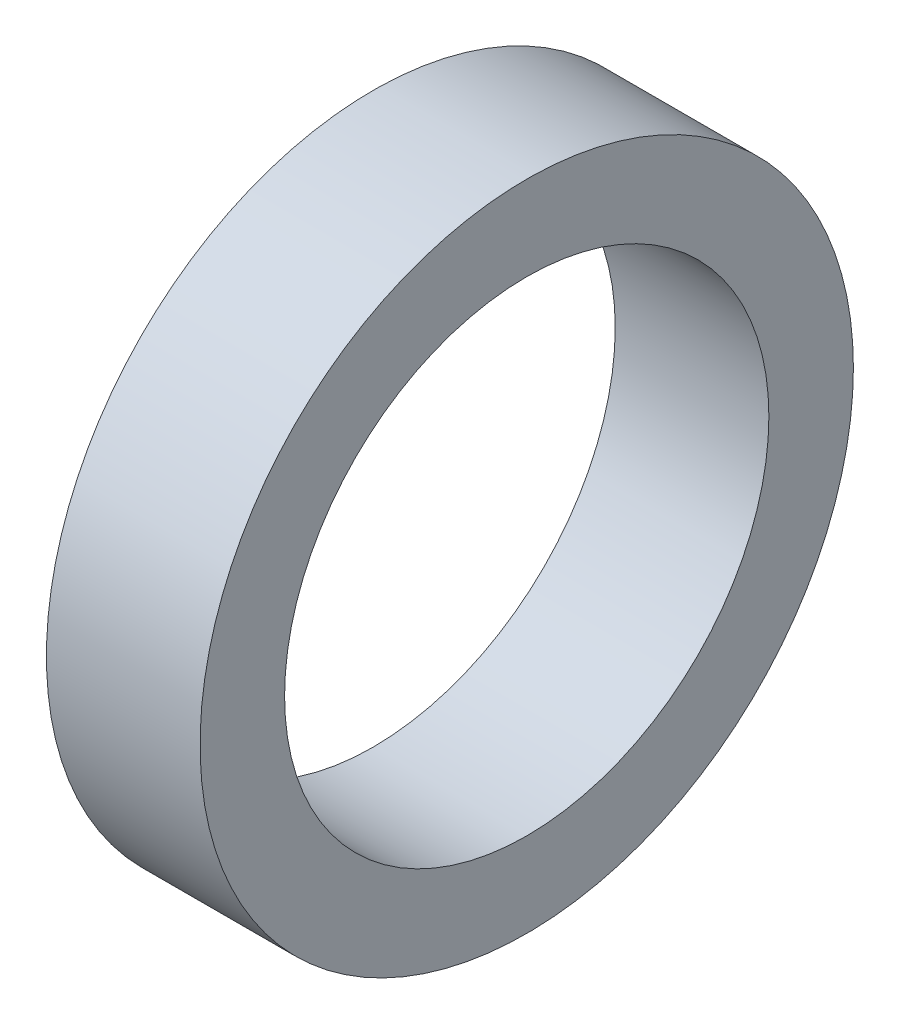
ISO-10303-21;
HEADER;
FILE_DESCRIPTION(('STEP AP214'),'2;1');
FILE_NAME('part.step','',(''),(''),'','','');
FILE_SCHEMA(('AUTOMOTIVE_DESIGN { 1 0 10303 214 1 1 1 1 }'));
ENDSEC;
DATA;
#1=APPLICATION_CONTEXT('core data for automotive mechanical design processes');
#2=APPLICATION_PROTOCOL_DEFINITION('international standard','automotive_design',2000,#1);
#3=PRODUCT_CONTEXT('',#1,'mechanical');
#4=PRODUCT('Part','Part','',(#3));
#5=PRODUCT_RELATED_PRODUCT_CATEGORY('part','',(#4));
#6=PRODUCT_DEFINITION_FORMATION('','',#4);
#7=PRODUCT_DEFINITION_CONTEXT('part definition',#1,'design');
#8=PRODUCT_DEFINITION('design','',#6,#7);
#9=PRODUCT_DEFINITION_SHAPE('','',#8);
#10=(LENGTH_UNIT() NAMED_UNIT(*) SI_UNIT(.MILLI.,.METRE.));
#11=(NAMED_UNIT(*) PLANE_ANGLE_UNIT() SI_UNIT($,.RADIAN.));
#12=(NAMED_UNIT(*) SI_UNIT($,.STERADIAN.) SOLID_ANGLE_UNIT());
#13=UNCERTAINTY_MEASURE_WITH_UNIT(LENGTH_MEASURE(1.E-05),#10,'distance_accuracy_value','');
#14=(GEOMETRIC_REPRESENTATION_CONTEXT(3) GLOBAL_UNCERTAINTY_ASSIGNED_CONTEXT((#13)) GLOBAL_UNIT_ASSIGNED_CONTEXT((#10,
#11,#12)) REPRESENTATION_CONTEXT('',''));
#15=CARTESIAN_POINT('',(0.,0.,0.));
#16=DIRECTION('',(0.,0.,1.));
#17=DIRECTION('',(1.,0.,0.));
#18=AXIS2_PLACEMENT_3D('',#15,#16,#17);
#19=CARTESIAN_POINT('',(6.35,0.,0.));
#20=DIRECTION('',(1.,0.,0.));
#21=DIRECTION('',(0.,0.,-1.));
#22=AXIS2_PLACEMENT_3D('',#19,#20,#21);
#23=PLANE('',#22);
#24=CARTESIAN_POINT('',(6.35,0.,0.));
#25=DIRECTION('',(1.,0.,0.));
#26=DIRECTION('',(0.,0.,-1.));
#27=AXIS2_PLACEMENT_3D('',#24,#25,#26);
#28=CIRCLE('',#27,13.5001);
#29=CARTESIAN_POINT('',(6.35,0.,-13.5001));
#30=VERTEX_POINT('',#29);
#31=EDGE_CURVE('E10',#30,#30,#28,.T.);
#32=ORIENTED_EDGE('',*,*,#31,.T.);
#33=EDGE_LOOP('',(#32));
#34=FACE_BOUND('',#33,.T.);
#35=CARTESIAN_POINT('',(6.35,0.,0.));
#36=DIRECTION('',(1.,0.,0.));
#37=DIRECTION('',(0.,0.,-1.));
#38=AXIS2_PLACEMENT_3D('',#35,#36,#37);
#39=CIRCLE('',#38,10.0076);
#40=CARTESIAN_POINT('',(6.35,0.,-10.0076));
#41=VERTEX_POINT('',#40);
#42=EDGE_CURVE('E42',#41,#41,#39,.T.);
#43=ORIENTED_EDGE('',*,*,#42,.F.);
#44=EDGE_LOOP('',(#43));
#45=FACE_BOUND('',#44,.T.);
#46=ADVANCED_FACE('F31',(#34,#45),#23,.T.);
#47=CARTESIAN_POINT('',(0.,0.,0.));
#48=DIRECTION('',(1.,0.,0.));
#49=DIRECTION('',(0.,0.,-1.));
#50=AXIS2_PLACEMENT_3D('',#47,#48,#49);
#51=PLANE('',#50);
#52=CARTESIAN_POINT('',(0.,0.,0.));
#53=DIRECTION('',(1.,0.,0.));
#54=DIRECTION('',(0.,0.,-1.));
#55=AXIS2_PLACEMENT_3D('',#52,#53,#54);
#56=CIRCLE('',#55,13.5001);
#57=CARTESIAN_POINT('',(0.,0.,-13.5001));
#58=VERTEX_POINT('',#57);
#59=EDGE_CURVE('E35',#58,#58,#56,.T.);
#60=ORIENTED_EDGE('',*,*,#59,.F.);
#61=EDGE_LOOP('',(#60));
#62=FACE_BOUND('',#61,.T.);
#63=CARTESIAN_POINT('',(0.,0.,0.));
#64=DIRECTION('',(1.,0.,0.));
#65=DIRECTION('',(0.,0.,-1.));
#66=AXIS2_PLACEMENT_3D('',#63,#64,#65);
#67=CIRCLE('',#66,10.0076);
#68=CARTESIAN_POINT('',(0.,0.,-10.0076));
#69=VERTEX_POINT('',#68);
#70=EDGE_CURVE('E44',#69,#69,#67,.T.);
#71=ORIENTED_EDGE('',*,*,#70,.T.);
#72=EDGE_LOOP('',(#71));
#73=FACE_BOUND('',#72,.T.);
#74=ADVANCED_FACE('F54',(#62,#73),#51,.F.);
#75=CARTESIAN_POINT('',(6.35,0.,0.));
#76=DIRECTION('',(-1.,0.,0.));
#77=DIRECTION('',(0.,0.,1.));
#78=AXIS2_PLACEMENT_3D('',#75,#76,#77);
#79=CYLINDRICAL_SURFACE('',#78,13.5001);
#80=ORIENTED_EDGE('',*,*,#31,.F.);
#81=EDGE_LOOP('',(#80));
#82=FACE_BOUND('',#81,.T.);
#83=ORIENTED_EDGE('',*,*,#59,.T.);
#84=EDGE_LOOP('',(#83));
#85=FACE_BOUND('',#84,.T.);
#86=ADVANCED_FACE('F33',(#82,#85),#79,.T.);
#87=CARTESIAN_POINT('',(6.35,0.,0.));
#88=DIRECTION('',(-1.,0.,0.));
#89=DIRECTION('',(0.,0.,1.));
#90=AXIS2_PLACEMENT_3D('',#87,#88,#89);
#91=CYLINDRICAL_SURFACE('',#90,10.0076);
#92=ORIENTED_EDGE('',*,*,#42,.T.);
#93=EDGE_LOOP('',(#92));
#94=FACE_BOUND('',#93,.T.);
#95=ORIENTED_EDGE('',*,*,#70,.F.);
#96=EDGE_LOOP('',(#95));
#97=FACE_BOUND('',#96,.T.);
#98=ADVANCED_FACE('F50',(#94,#97),#91,.F.);
#99=CLOSED_SHELL('',(#46,#74,#86,#98));
#100=MANIFOLD_SOLID_BREP('B2',#99);
#101=ADVANCED_BREP_SHAPE_REPRESENTATION('',(#18,#100),#14);
#102=SHAPE_DEFINITION_REPRESENTATION(#9,#101);
ENDSEC;
END-ISO-10303-21;
